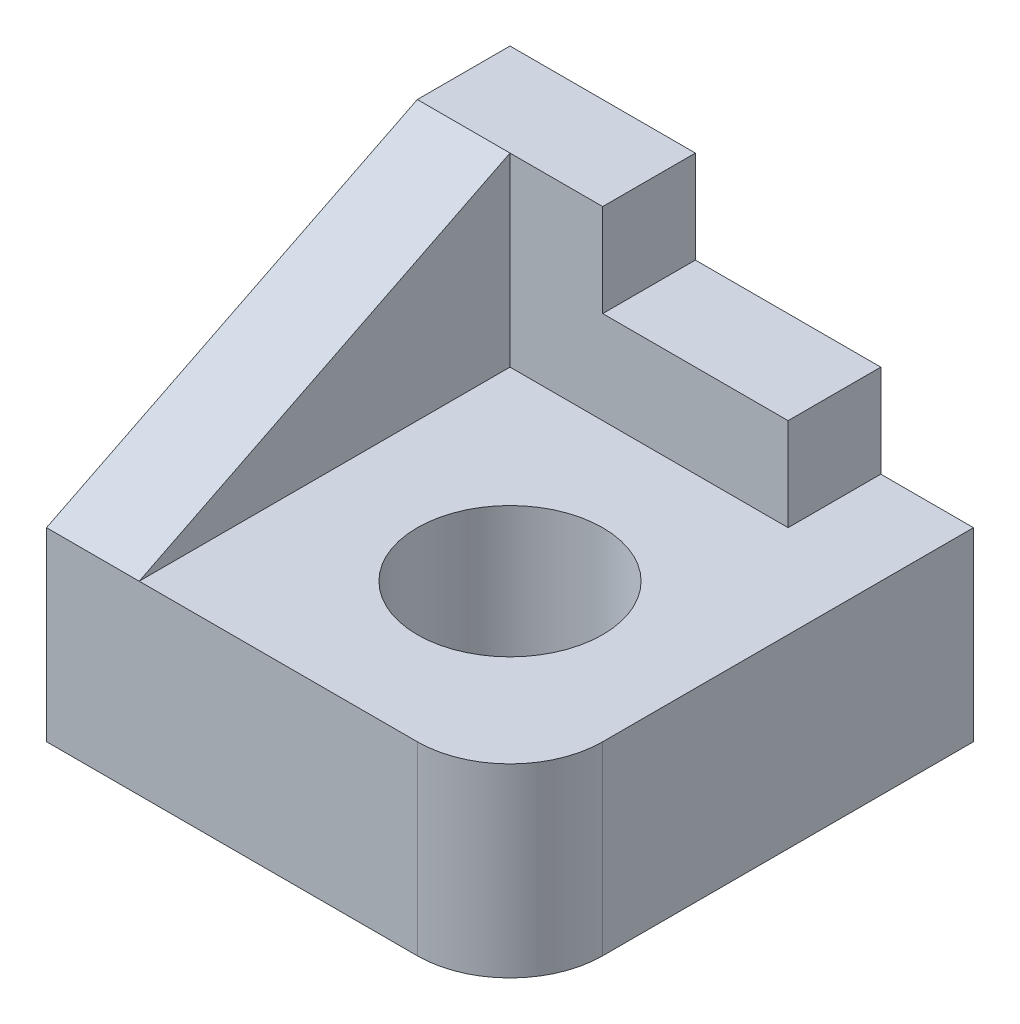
from build123d import *

# Parameters (mm, degrees)
SKETCH1_W      = 50
SKETCH1_H      = 50
EXTRUDE1_DEPTH = 20
FILLET1_R      = 10
SKETCH2_R      = 10
EXTRUDE2_DEPTH = 20
EXTRUDE3_DEPTH = 10
RIB2_REACH     = 83.24
SKETCH4_WALL_W = 209.202127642
SKETCH4_WALL_H = 10


with BuildPart() as part:
    # Sketch1 → Extrude1 (new body)
    with BuildSketch(Plane(origin=(0, 0, 0), x_dir=(1, 0, 0), z_dir=(0, 1, 0))):
        with Locations((25, -25)):
            Rectangle(SKETCH1_W, SKETCH1_H)
    extrude(amount=EXTRUDE1_DEPTH)

    # Fillet1
    fillet1_edges = [part.edges().sort_by_distance(p)[0] for p in [
        (50, 10, 50),
    ]]
    fillet(fillet1_edges, radius=FILLET1_R)

    # Sketch2 → Extrude2 (cut)
    with BuildSketch(Plane(origin=(0, 20, 0), x_dir=(1, 0, 0), z_dir=(0, 1, 0))):
        with Locations(Location((30, -30, 0), (0, 0, 270))):
            Circle(SKETCH2_R)
    extrude(amount=-EXTRUDE2_DEPTH, mode=Mode.SUBTRACT)

    # Sketch3 → Extrude3 (add)
    with BuildSketch(Plane(origin=(0, 0, 0), x_dir=(-1, 0, 0), z_dir=(0, 0, -1))):
        Polygon((0, 20), (0, 40), (-20, 40), (-20, 30), (-40, 30), (-40, 20), align=None)
    extrude(amount=-EXTRUDE3_DEPTH)

    # Sketch4 wall → Rib2 (add, up to next)
    with BuildSketch(Plane(origin=(0, 30, 30), x_dir=(0, -0.4472135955, 0.894427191), z_dir=(0, -0.894427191, -0.4472135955)), mode=Mode.PRIVATE) as rib2_sk1:
        with Locations((0, -5)):
            Rectangle(SKETCH4_WALL_W, SKETCH4_WALL_H)
    rib2_tool1 = extrude(rib2_sk1.sketch, amount=RIB2_REACH, mode=Mode.PRIVATE) - part.part
    add(rib2_tool1.solids().sort_by_distance((0, 30, 30))[0])


solid = part.part
